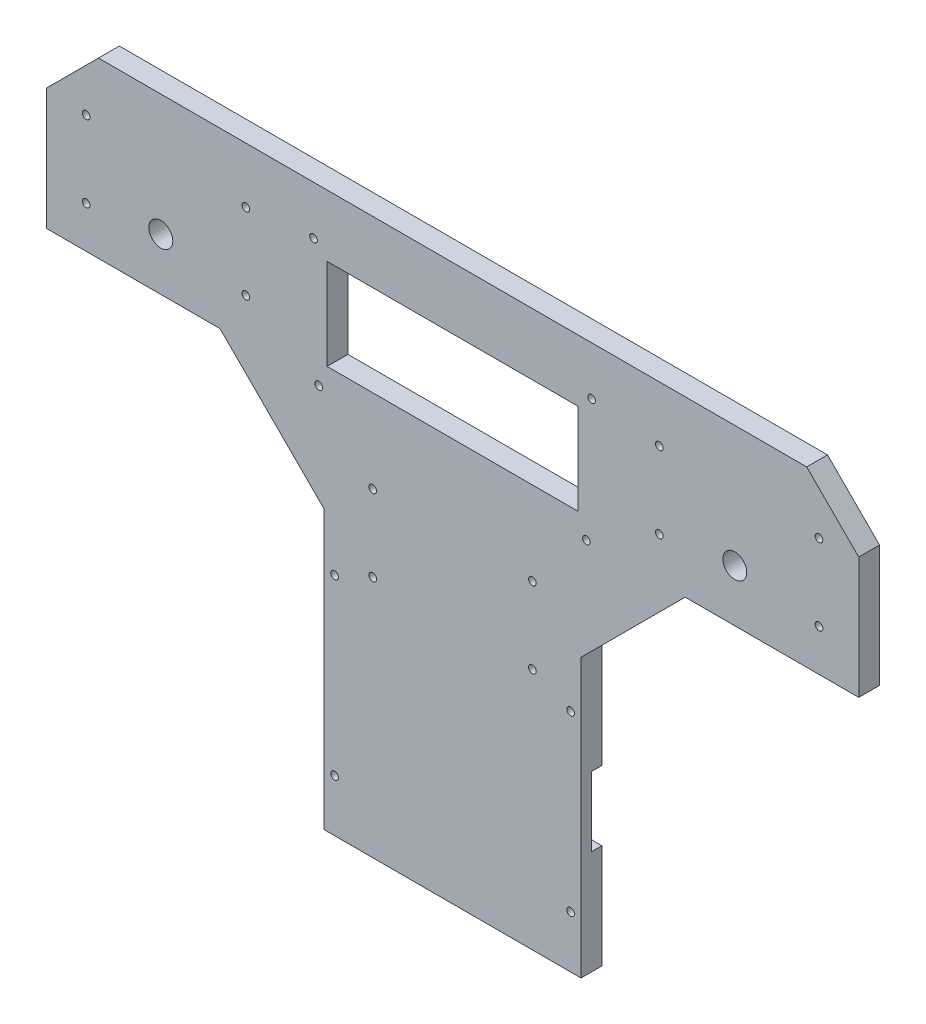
from build123d import *

# Parameters (mm, degrees)
ESQUISSE1_R             = 1.1
ESQUISSE1_R_2           = 3.45
ESQUISSE1_W             = 72.3
ESQUISSE1_H             = 26.2
BOSS_EXTRU_1_DEPTH      = 6
ENL_V_MAT_EXTRU_1_DEPTH = 3


with BuildPart() as part:
    # Esquisse1 → Boss.-Extru.1 (new body)
    with BuildSketch(Plane.XY):
        Polygon((154, 110), (104, 110), (74, 80), (74, 0), (0, 0), (0, 80), (-30, 110), (-80, 110), (-80, 145), (-65, 160), (139, 160), (154, 145), align=None)
        with Locations((-3.05, 146)):
            Circle(ESQUISSE1_R, mode=Mode.SUBTRACT)
        with Locations((-1.55, 110)):
            Circle(ESQUISSE1_R, mode=Mode.SUBTRACT)
        with Locations(Location((75.55, 110, 0), (0, 0, 180))):
            Circle(ESQUISSE1_R, mode=Mode.SUBTRACT)
        with Locations(Location((77.05, 146, 0), (0, 0, 180))):
            Circle(ESQUISSE1_R, mode=Mode.SUBTRACT)
        with Locations((14, 70)):
            Circle(ESQUISSE1_R, mode=Mode.SUBTRACT)
        with Locations(Location((14, 92, 0), (0, 0, 180))):
            Circle(ESQUISSE1_R, mode=Mode.SUBTRACT)
        with Locations(Location((60, 70, 0), (0, 0, 180))):
            Circle(ESQUISSE1_R, mode=Mode.SUBTRACT)
        with Locations((60, 92)):
            Circle(ESQUISSE1_R, mode=Mode.SUBTRACT)
        with Locations((96.55, 122)):
            Circle(ESQUISSE1_R, mode=Mode.SUBTRACT)
        with Locations(Location((142.55, 122, 0), (0, 0, 180))):
            Circle(ESQUISSE1_R, mode=Mode.SUBTRACT)
        with Locations((142.55, 144)):
            Circle(ESQUISSE1_R, mode=Mode.SUBTRACT)
        with Locations(Location((96.55, 144, 0), (0, 0, 180))):
            Circle(ESQUISSE1_R, mode=Mode.SUBTRACT)
        with Locations((118.28, 125)):
            Circle(ESQUISSE1_R_2, mode=Mode.SUBTRACT)
        with Locations(Location((-47.05, 125, 0), (0, 0, 180))):
            Circle(ESQUISSE1_R_2, mode=Mode.SUBTRACT)
        with Locations((-22.55, 144)):
            Circle(ESQUISSE1_R, mode=Mode.SUBTRACT)
        with Locations(Location((-68.55, 144, 0), (0, 0, 180))):
            Circle(ESQUISSE1_R, mode=Mode.SUBTRACT)
        with Locations((-68.55, 122)):
            Circle(ESQUISSE1_R, mode=Mode.SUBTRACT)
        with Locations(Location((-22.55, 122, 0), (0, 0, 180))):
            Circle(ESQUISSE1_R, mode=Mode.SUBTRACT)
        with Locations((71, 15)):
            Circle(ESQUISSE1_R, mode=Mode.SUBTRACT)
        with Locations(Location((71, 65, 0), (0, 0, 180))):
            Circle(ESQUISSE1_R, mode=Mode.SUBTRACT)
        with Locations(Location((3, 15, 0), (0, 0, 180))):
            Circle(ESQUISSE1_R, mode=Mode.SUBTRACT)
        with Locations((3, 65)):
            Circle(ESQUISSE1_R, mode=Mode.SUBTRACT)
        with Locations((37, 129.1)):
            Rectangle(ESQUISSE1_W, ESQUISSE1_H, mode=Mode.SUBTRACT)
    extrude(amount=BOSS_EXTRU_1_DEPTH)

    # Esquisse2 → Enl_v. mat.-Extru.1 (cut)
    with BuildSketch(Plane(origin=(0, 0, 0), x_dir=(-1, 0, 0), z_dir=(0, 0, -1))):
        with BuildLine():
            Line((-3.7372583, 30), (0, 30))
            Line((0, 30), (0, 50))
            Line((0, 50), (-3.7372583, 50))
            ThreePointArc((-3.7372583, 50), (-6, 50), (-6, 47.7372583))
            Line((-6, 47.7372583), (-6, 32.2627417))
            ThreePointArc((-6, 32.2627417), (-6, 30), (-3.7372583, 30))
        make_face()
        with BuildLine():
            Line((-74, 50), (-74, 30))
            Line((-74, 30), (-70.2627417, 30))
            ThreePointArc((-70.2627417, 30), (-68, 30), (-68, 32.2627417))
            Line((-68, 32.2627417), (-68, 47.7372583))
            ThreePointArc((-68, 47.7372583), (-68, 50), (-70.2627417, 50))
            Line((-70.2627417, 50), (-74, 50))
        make_face()
    extrude(amount=-ENL_V_MAT_EXTRU_1_DEPTH, mode=Mode.SUBTRACT)


solid = part.part
